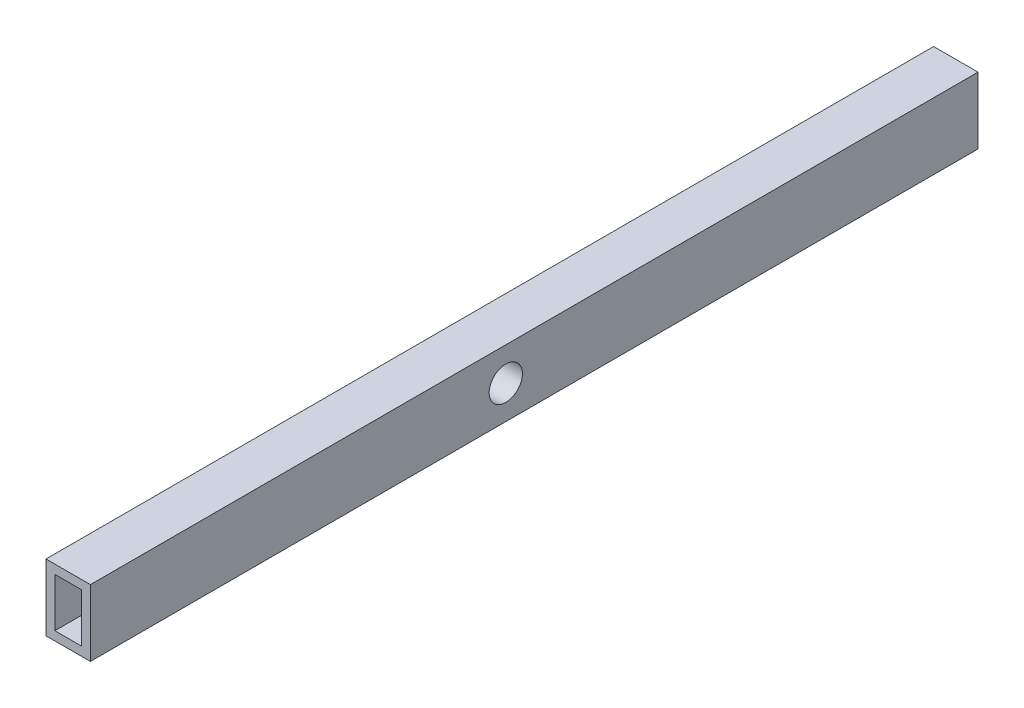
ISO-10303-21;
HEADER;
FILE_DESCRIPTION(('STEP AP214'),'2;1');
FILE_NAME('part.step','',(''),(''),'','','');
FILE_SCHEMA(('AUTOMOTIVE_DESIGN { 1 0 10303 214 1 1 1 1 }'));
ENDSEC;
DATA;
#1=APPLICATION_CONTEXT('core data for automotive mechanical design processes');
#2=APPLICATION_PROTOCOL_DEFINITION('international standard','automotive_design',2000,#1);
#3=PRODUCT_CONTEXT('',#1,'mechanical');
#4=PRODUCT('Part','Part','',(#3));
#5=PRODUCT_RELATED_PRODUCT_CATEGORY('part','',(#4));
#6=PRODUCT_DEFINITION_FORMATION('','',#4);
#7=PRODUCT_DEFINITION_CONTEXT('part definition',#1,'design');
#8=PRODUCT_DEFINITION('design','',#6,#7);
#9=PRODUCT_DEFINITION_SHAPE('','',#8);
#10=(LENGTH_UNIT() NAMED_UNIT(*) SI_UNIT(.MILLI.,.METRE.));
#11=(NAMED_UNIT(*) PLANE_ANGLE_UNIT() SI_UNIT($,.RADIAN.));
#12=(NAMED_UNIT(*) SI_UNIT($,.STERADIAN.) SOLID_ANGLE_UNIT());
#13=UNCERTAINTY_MEASURE_WITH_UNIT(LENGTH_MEASURE(1.E-05),#10,'distance_accuracy_value','');
#14=(GEOMETRIC_REPRESENTATION_CONTEXT(3) GLOBAL_UNCERTAINTY_ASSIGNED_CONTEXT((#13)) GLOBAL_UNIT_ASSIGNED_CONTEXT((#10,
#11,#12)) REPRESENTATION_CONTEXT('',''));
#15=CARTESIAN_POINT('',(0.,0.,0.));
#16=DIRECTION('',(0.,0.,1.));
#17=DIRECTION('',(1.,0.,0.));
#18=AXIS2_PLACEMENT_3D('',#15,#16,#17);
#19=CARTESIAN_POINT('',(0.,19.05,254.));
#20=DIRECTION('',(0.,0.,1.));
#21=DIRECTION('',(1.,0.,0.));
#22=AXIS2_PLACEMENT_3D('',#19,#20,#21);
#23=PLANE('',#22);
#24=DIRECTION('',(-1.,0.,0.));
#25=VECTOR('',#24,1.);
#26=CARTESIAN_POINT('',(0.,19.05,254.));
#27=LINE('',#26,#25);
#28=CARTESIAN_POINT('',(12.7,19.05,254.));
#29=VERTEX_POINT('',#28);
#30=CARTESIAN_POINT('',(0.,19.05,254.));
#31=VERTEX_POINT('',#30);
#32=EDGE_CURVE('E142',#29,#31,#27,.T.);
#33=ORIENTED_EDGE('',*,*,#32,.T.);
#34=DIRECTION('',(0.,-1.,0.));
#35=VECTOR('',#34,1.);
#36=CARTESIAN_POINT('',(0.,19.05,254.));
#37=LINE('',#36,#35);
#38=CARTESIAN_POINT('',(0.,0.,254.));
#39=VERTEX_POINT('',#38);
#40=EDGE_CURVE('E145',#31,#39,#37,.T.);
#41=ORIENTED_EDGE('',*,*,#40,.T.);
#42=DIRECTION('',(1.,0.,0.));
#43=VECTOR('',#42,1.);
#44=CARTESIAN_POINT('',(0.,0.,254.));
#45=LINE('',#44,#43);
#46=CARTESIAN_POINT('',(12.7,0.,254.));
#47=VERTEX_POINT('',#46);
#48=EDGE_CURVE('E147',#39,#47,#45,.T.);
#49=ORIENTED_EDGE('',*,*,#48,.T.);
#50=DIRECTION('',(0.,1.,0.));
#51=VECTOR('',#50,1.);
#52=CARTESIAN_POINT('',(12.7,19.05,254.));
#53=LINE('',#52,#51);
#54=EDGE_CURVE('E149',#47,#29,#53,.T.);
#55=ORIENTED_EDGE('',*,*,#54,.T.);
#56=EDGE_LOOP('',(#33,#41,#49,#55));
#57=FACE_BOUND('',#56,.T.);
#58=DIRECTION('',(0.,-1.,0.));
#59=VECTOR('',#58,1.);
#60=CARTESIAN_POINT('',(2.54,19.05,254.));
#61=LINE('',#60,#59);
#62=CARTESIAN_POINT('',(2.54,16.51,254.));
#63=VERTEX_POINT('',#62);
#64=CARTESIAN_POINT('',(2.54,2.54,254.));
#65=VERTEX_POINT('',#64);
#66=EDGE_CURVE('E124',#63,#65,#61,.T.);
#67=ORIENTED_EDGE('',*,*,#66,.F.);
#68=DIRECTION('',(-1.,0.,0.));
#69=VECTOR('',#68,1.);
#70=CARTESIAN_POINT('',(0.,16.51,254.));
#71=LINE('',#70,#69);
#72=CARTESIAN_POINT('',(10.16,16.51,254.));
#73=VERTEX_POINT('',#72);
#74=EDGE_CURVE('E108',#73,#63,#71,.T.);
#75=ORIENTED_EDGE('',*,*,#74,.F.);
#76=DIRECTION('',(0.,1.,0.));
#77=VECTOR('',#76,1.);
#78=CARTESIAN_POINT('',(10.16,19.05,254.));
#79=LINE('',#78,#77);
#80=CARTESIAN_POINT('',(10.16,2.54,254.));
#81=VERTEX_POINT('',#80);
#82=EDGE_CURVE('E128',#81,#73,#79,.T.);
#83=ORIENTED_EDGE('',*,*,#82,.F.);
#84=DIRECTION('',(1.,0.,0.));
#85=VECTOR('',#84,1.);
#86=CARTESIAN_POINT('',(0.,2.54,254.));
#87=LINE('',#86,#85);
#88=EDGE_CURVE('E126',#65,#81,#87,.T.);
#89=ORIENTED_EDGE('',*,*,#88,.F.);
#90=EDGE_LOOP('',(#67,#75,#83,#89));
#91=FACE_BOUND('',#90,.T.);
#92=ADVANCED_FACE('F27',(#57,#91),#23,.T.);
#93=CARTESIAN_POINT('',(0.,19.05,0.));
#94=DIRECTION('',(0.,0.,1.));
#95=DIRECTION('',(1.,0.,0.));
#96=AXIS2_PLACEMENT_3D('',#93,#94,#95);
#97=PLANE('',#96);
#98=DIRECTION('',(-1.,0.,0.));
#99=VECTOR('',#98,1.);
#100=CARTESIAN_POINT('',(0.,19.05,0.));
#101=LINE('',#100,#99);
#102=CARTESIAN_POINT('',(12.7,19.05,0.));
#103=VERTEX_POINT('',#102);
#104=CARTESIAN_POINT('',(0.,19.05,0.));
#105=VERTEX_POINT('',#104);
#106=EDGE_CURVE('E109',#103,#105,#101,.T.);
#107=ORIENTED_EDGE('',*,*,#106,.F.);
#108=DIRECTION('',(0.,1.,0.));
#109=VECTOR('',#108,1.);
#110=CARTESIAN_POINT('',(12.7,19.05,0.));
#111=LINE('',#110,#109);
#112=CARTESIAN_POINT('',(12.7,0.,0.));
#113=VERTEX_POINT('',#112);
#114=EDGE_CURVE('E140',#113,#103,#111,.T.);
#115=ORIENTED_EDGE('',*,*,#114,.F.);
#116=DIRECTION('',(1.,0.,0.));
#117=VECTOR('',#116,1.);
#118=CARTESIAN_POINT('',(0.,0.,0.));
#119=LINE('',#118,#117);
#120=CARTESIAN_POINT('',(0.,0.,0.));
#121=VERTEX_POINT('',#120);
#122=EDGE_CURVE('E138',#121,#113,#119,.T.);
#123=ORIENTED_EDGE('',*,*,#122,.F.);
#124=DIRECTION('',(0.,-1.,0.));
#125=VECTOR('',#124,1.);
#126=CARTESIAN_POINT('',(0.,19.05,0.));
#127=LINE('',#126,#125);
#128=EDGE_CURVE('E136',#105,#121,#127,.T.);
#129=ORIENTED_EDGE('',*,*,#128,.F.);
#130=EDGE_LOOP('',(#107,#115,#123,#129));
#131=FACE_BOUND('',#130,.T.);
#132=DIRECTION('',(-1.,0.,0.));
#133=VECTOR('',#132,1.);
#134=CARTESIAN_POINT('',(0.,16.51,0.));
#135=LINE('',#134,#133);
#136=CARTESIAN_POINT('',(10.16,16.51,0.));
#137=VERTEX_POINT('',#136);
#138=CARTESIAN_POINT('',(2.54,16.51,0.));
#139=VERTEX_POINT('',#138);
#140=EDGE_CURVE('E51',#137,#139,#135,.T.);
#141=ORIENTED_EDGE('',*,*,#140,.T.);
#142=DIRECTION('',(0.,-1.,0.));
#143=VECTOR('',#142,1.);
#144=CARTESIAN_POINT('',(2.54,19.05,0.));
#145=LINE('',#144,#143);
#146=CARTESIAN_POINT('',(2.54,2.54,0.));
#147=VERTEX_POINT('',#146);
#148=EDGE_CURVE('E95',#139,#147,#145,.T.);
#149=ORIENTED_EDGE('',*,*,#148,.T.);
#150=DIRECTION('',(1.,0.,0.));
#151=VECTOR('',#150,1.);
#152=CARTESIAN_POINT('',(0.,2.54,0.));
#153=LINE('',#152,#151);
#154=CARTESIAN_POINT('',(10.16,2.54,0.));
#155=VERTEX_POINT('',#154);
#156=EDGE_CURVE('E104',#147,#155,#153,.T.);
#157=ORIENTED_EDGE('',*,*,#156,.T.);
#158=DIRECTION('',(0.,1.,0.));
#159=VECTOR('',#158,1.);
#160=CARTESIAN_POINT('',(10.16,19.05,0.));
#161=LINE('',#160,#159);
#162=EDGE_CURVE('E113',#155,#137,#161,.T.);
#163=ORIENTED_EDGE('',*,*,#162,.T.);
#164=EDGE_LOOP('',(#141,#149,#157,#163));
#165=FACE_BOUND('',#164,.T.);
#166=ADVANCED_FACE('F112',(#131,#165),#97,.F.);
#167=CARTESIAN_POINT('',(0.,19.05,254.));
#168=DIRECTION('',(0.,-1.,0.));
#169=DIRECTION('',(0.,0.,-1.));
#170=AXIS2_PLACEMENT_3D('',#167,#168,#169);
#171=PLANE('',#170);
#172=ORIENTED_EDGE('',*,*,#106,.T.);
#173=DIRECTION('',(0.,0.,-1.));
#174=VECTOR('',#173,1.);
#175=CARTESIAN_POINT('',(0.,19.05,254.));
#176=LINE('',#175,#174);
#177=EDGE_CURVE('E159',#31,#105,#176,.T.);
#178=ORIENTED_EDGE('',*,*,#177,.F.);
#179=ORIENTED_EDGE('',*,*,#32,.F.);
#180=DIRECTION('',(0.,0.,-1.));
#181=VECTOR('',#180,1.);
#182=CARTESIAN_POINT('',(12.7,19.05,254.));
#183=LINE('',#182,#181);
#184=EDGE_CURVE('E151',#29,#103,#183,.T.);
#185=ORIENTED_EDGE('',*,*,#184,.T.);
#186=EDGE_LOOP('',(#172,#178,#179,#185));
#187=FACE_BOUND('',#186,.T.);
#188=ADVANCED_FACE('F29',(#187),#171,.F.);
#189=CARTESIAN_POINT('',(0.,19.05,254.));
#190=DIRECTION('',(1.,0.,0.));
#191=DIRECTION('',(0.,1.,0.));
#192=AXIS2_PLACEMENT_3D('',#189,#190,#191);
#193=PLANE('',#192);
#194=ORIENTED_EDGE('',*,*,#128,.T.);
#195=DIRECTION('',(0.,0.,-1.));
#196=VECTOR('',#195,1.);
#197=CARTESIAN_POINT('',(0.,0.,254.));
#198=LINE('',#197,#196);
#199=EDGE_CURVE('E157',#39,#121,#198,.T.);
#200=ORIENTED_EDGE('',*,*,#199,.F.);
#201=ORIENTED_EDGE('',*,*,#40,.F.);
#202=ORIENTED_EDGE('',*,*,#177,.T.);
#203=EDGE_LOOP('',(#194,#200,#201,#202));
#204=FACE_BOUND('',#203,.T.);
#205=CARTESIAN_POINT('',(0.,9.525,135.129858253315));
#206=DIRECTION('',(1.,0.,0.));
#207=DIRECTION('',(0.,0.,-1.));
#208=AXIS2_PLACEMENT_3D('',#205,#206,#207);
#209=CIRCLE('',#208,4.7625);
#210=CARTESIAN_POINT('',(0.,9.525,130.367358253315));
#211=VERTEX_POINT('',#210);
#212=EDGE_CURVE('E114',#211,#211,#209,.T.);
#213=ORIENTED_EDGE('',*,*,#212,.T.);
#214=EDGE_LOOP('',(#213));
#215=FACE_BOUND('',#214,.T.);
#216=ADVANCED_FACE('F193',(#204,#215),#193,.F.);
#217=CARTESIAN_POINT('',(0.,0.,254.));
#218=DIRECTION('',(0.,1.,0.));
#219=DIRECTION('',(0.,0.,1.));
#220=AXIS2_PLACEMENT_3D('',#217,#218,#219);
#221=PLANE('',#220);
#222=ORIENTED_EDGE('',*,*,#122,.T.);
#223=DIRECTION('',(0.,0.,-1.));
#224=VECTOR('',#223,1.);
#225=CARTESIAN_POINT('',(12.7,0.,254.));
#226=LINE('',#225,#224);
#227=EDGE_CURVE('E154',#47,#113,#226,.T.);
#228=ORIENTED_EDGE('',*,*,#227,.F.);
#229=ORIENTED_EDGE('',*,*,#48,.F.);
#230=ORIENTED_EDGE('',*,*,#199,.T.);
#231=EDGE_LOOP('',(#222,#228,#229,#230));
#232=FACE_BOUND('',#231,.T.);
#233=ADVANCED_FACE('F190',(#232),#221,.F.);
#234=CARTESIAN_POINT('',(12.7,19.05,254.));
#235=DIRECTION('',(-1.,0.,0.));
#236=DIRECTION('',(0.,-1.,0.));
#237=AXIS2_PLACEMENT_3D('',#234,#235,#236);
#238=PLANE('',#237);
#239=ORIENTED_EDGE('',*,*,#114,.T.);
#240=ORIENTED_EDGE('',*,*,#184,.F.);
#241=ORIENTED_EDGE('',*,*,#54,.F.);
#242=ORIENTED_EDGE('',*,*,#227,.T.);
#243=EDGE_LOOP('',(#239,#240,#241,#242));
#244=FACE_BOUND('',#243,.T.);
#245=CARTESIAN_POINT('',(12.7,9.525,135.129858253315));
#246=DIRECTION('',(1.,0.,0.));
#247=DIRECTION('',(0.,0.,-1.));
#248=AXIS2_PLACEMENT_3D('',#245,#246,#247);
#249=CIRCLE('',#248,4.76249999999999);
#250=CARTESIAN_POINT('',(12.7,9.525,130.367358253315));
#251=VERTEX_POINT('',#250);
#252=EDGE_CURVE('E117',#251,#251,#249,.T.);
#253=ORIENTED_EDGE('',*,*,#252,.F.);
#254=EDGE_LOOP('',(#253));
#255=FACE_BOUND('',#254,.T.);
#256=ADVANCED_FACE('F187',(#244,#255),#238,.F.);
#257=CARTESIAN_POINT('',(0.,16.51,254.));
#258=DIRECTION('',(0.,-1.,0.));
#259=DIRECTION('',(0.,0.,-1.));
#260=AXIS2_PLACEMENT_3D('',#257,#258,#259);
#261=PLANE('',#260);
#262=ORIENTED_EDGE('',*,*,#140,.F.);
#263=DIRECTION('',(0.,0.,-1.));
#264=VECTOR('',#263,1.);
#265=CARTESIAN_POINT('',(10.16,16.51,254.));
#266=LINE('',#265,#264);
#267=EDGE_CURVE('E130',#73,#137,#266,.T.);
#268=ORIENTED_EDGE('',*,*,#267,.F.);
#269=ORIENTED_EDGE('',*,*,#74,.T.);
#270=DIRECTION('',(0.,0.,-1.));
#271=VECTOR('',#270,1.);
#272=CARTESIAN_POINT('',(2.54,16.51,254.));
#273=LINE('',#272,#271);
#274=EDGE_CURVE('E97',#63,#139,#273,.T.);
#275=ORIENTED_EDGE('',*,*,#274,.T.);
#276=EDGE_LOOP('',(#262,#268,#269,#275));
#277=FACE_BOUND('',#276,.T.);
#278=ADVANCED_FACE('F106',(#277),#261,.T.);
#279=CARTESIAN_POINT('',(2.54,19.05,254.));
#280=DIRECTION('',(1.,0.,0.));
#281=DIRECTION('',(0.,1.,0.));
#282=AXIS2_PLACEMENT_3D('',#279,#280,#281);
#283=PLANE('',#282);
#284=CARTESIAN_POINT('',(2.54,9.525,135.129858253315));
#285=DIRECTION('',(1.,0.,0.));
#286=DIRECTION('',(0.,1.,0.));
#287=AXIS2_PLACEMENT_3D('',#284,#285,#286);
#288=CIRCLE('',#287,6.34999999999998);
#289=CARTESIAN_POINT('',(2.54,15.875,135.129858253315));
#290=VERTEX_POINT('',#289);
#291=EDGE_CURVE('E11',#290,#290,#288,.T.);
#292=ORIENTED_EDGE('',*,*,#291,.F.);
#293=EDGE_LOOP('',(#292));
#294=FACE_BOUND('',#293,.T.);
#295=ORIENTED_EDGE('',*,*,#148,.F.);
#296=ORIENTED_EDGE('',*,*,#274,.F.);
#297=ORIENTED_EDGE('',*,*,#66,.T.);
#298=DIRECTION('',(0.,0.,-1.));
#299=VECTOR('',#298,1.);
#300=CARTESIAN_POINT('',(2.54,2.54,254.));
#301=LINE('',#300,#299);
#302=EDGE_CURVE('E100',#65,#147,#301,.T.);
#303=ORIENTED_EDGE('',*,*,#302,.T.);
#304=EDGE_LOOP('',(#295,#296,#297,#303));
#305=FACE_BOUND('',#304,.T.);
#306=ADVANCED_FACE('F96',(#294,#305),#283,.T.);
#307=CARTESIAN_POINT('',(0.,2.54,254.));
#308=DIRECTION('',(0.,1.,0.));
#309=DIRECTION('',(0.,0.,1.));
#310=AXIS2_PLACEMENT_3D('',#307,#308,#309);
#311=PLANE('',#310);
#312=ORIENTED_EDGE('',*,*,#156,.F.);
#313=ORIENTED_EDGE('',*,*,#302,.F.);
#314=ORIENTED_EDGE('',*,*,#88,.T.);
#315=DIRECTION('',(0.,0.,-1.));
#316=VECTOR('',#315,1.);
#317=CARTESIAN_POINT('',(10.16,2.54,254.));
#318=LINE('',#317,#316);
#319=EDGE_CURVE('E43',#81,#155,#318,.T.);
#320=ORIENTED_EDGE('',*,*,#319,.T.);
#321=EDGE_LOOP('',(#312,#313,#314,#320));
#322=FACE_BOUND('',#321,.T.);
#323=ADVANCED_FACE('F171',(#322),#311,.T.);
#324=CARTESIAN_POINT('',(10.16,19.05,254.));
#325=DIRECTION('',(-1.,0.,0.));
#326=DIRECTION('',(0.,-1.,0.));
#327=AXIS2_PLACEMENT_3D('',#324,#325,#326);
#328=PLANE('',#327);
#329=CARTESIAN_POINT('',(10.16,9.525,135.129858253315));
#330=DIRECTION('',(-1.,0.,0.));
#331=DIRECTION('',(0.,-1.,0.));
#332=AXIS2_PLACEMENT_3D('',#329,#330,#331);
#333=CIRCLE('',#332,6.34999999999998);
#334=CARTESIAN_POINT('',(10.16,3.17500000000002,135.129858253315));
#335=VERTEX_POINT('',#334);
#336=EDGE_CURVE('E31',#335,#335,#333,.T.);
#337=ORIENTED_EDGE('',*,*,#336,.F.);
#338=EDGE_LOOP('',(#337));
#339=FACE_BOUND('',#338,.T.);
#340=ORIENTED_EDGE('',*,*,#162,.F.);
#341=ORIENTED_EDGE('',*,*,#319,.F.);
#342=ORIENTED_EDGE('',*,*,#82,.T.);
#343=ORIENTED_EDGE('',*,*,#267,.T.);
#344=EDGE_LOOP('',(#340,#341,#342,#343));
#345=FACE_BOUND('',#344,.T.);
#346=ADVANCED_FACE('F168',(#339,#345),#328,.T.);
#347=CARTESIAN_POINT('',(12.7,9.525,135.129858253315));
#348=DIRECTION('',(1.,0.,0.));
#349=DIRECTION('',(0.,0.,-1.));
#350=AXIS2_PLACEMENT_3D('',#347,#348,#349);
#351=CYLINDRICAL_SURFACE('',#350,4.76249999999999);
#352=ORIENTED_EDGE('',*,*,#212,.F.);
#353=EDGE_LOOP('',(#352));
#354=FACE_BOUND('',#353,.T.);
#355=ORIENTED_EDGE('',*,*,#252,.T.);
#356=EDGE_LOOP('',(#355));
#357=FACE_BOUND('',#356,.T.);
#358=ADVANCED_FACE('F170',(#354,#357),#351,.F.);
#359=CARTESIAN_POINT('',(0.,9.525,135.129858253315));
#360=DIRECTION('',(1.,0.,0.));
#361=DIRECTION('',(0.,1.,0.));
#362=AXIS2_PLACEMENT_3D('',#359,#360,#361);
#363=CYLINDRICAL_SURFACE('',#362,6.34999999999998);
#364=ORIENTED_EDGE('',*,*,#291,.T.);
#365=EDGE_LOOP('',(#364));
#366=FACE_BOUND('',#365,.T.);
#367=ORIENTED_EDGE('',*,*,#336,.T.);
#368=EDGE_LOOP('',(#367));
#369=FACE_BOUND('',#368,.T.);
#370=ADVANCED_FACE('F166',(#366,#369),#363,.T.);
#371=CLOSED_SHELL('',(#92,#166,#188,#216,#233,#256,#278,#306,#323,#346,#358,#370));
#372=MANIFOLD_SOLID_BREP('B2',#371);
#373=ADVANCED_BREP_SHAPE_REPRESENTATION('',(#18,#372),#14);
#374=SHAPE_DEFINITION_REPRESENTATION(#9,#373);
ENDSEC;
END-ISO-10303-21;
